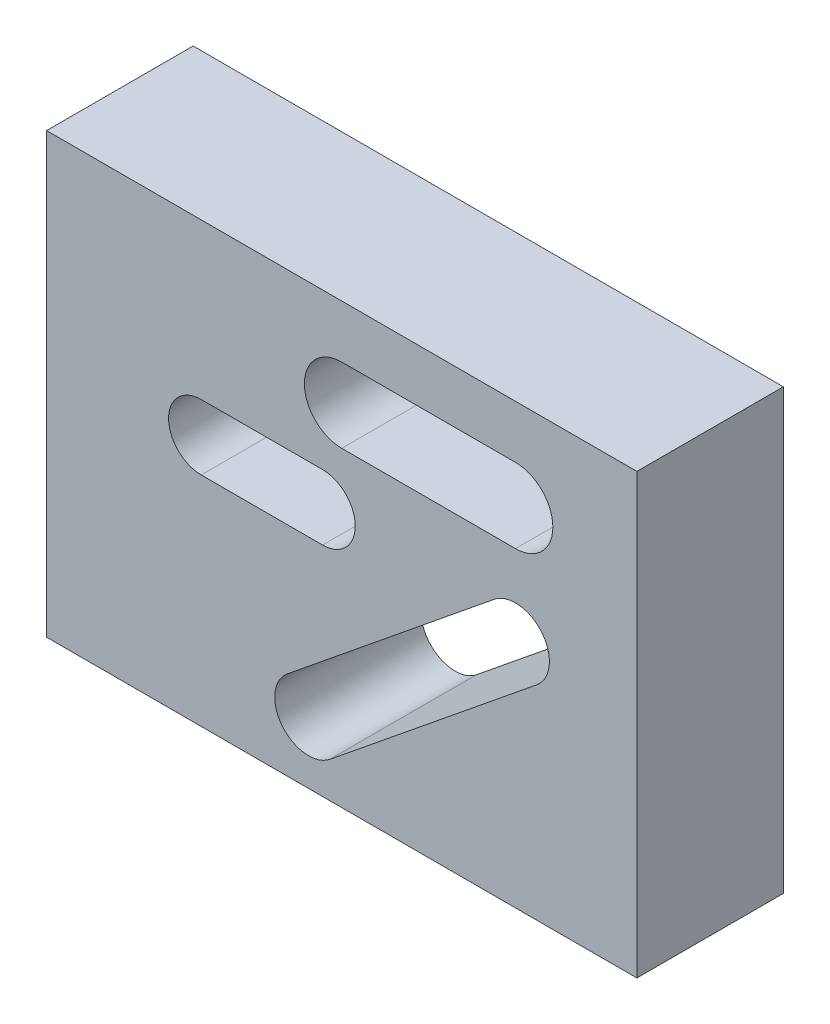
from build123d import *

# Parameters (mm, degrees)
SKIZZE1_W                       = 104.749436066
SKIZZE1_H                       = 77.860722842
AUFSATZ_LINEAR_AUSTRAGEN1_DEPTH = 26


with BuildPart() as part:
    # Skizze1 → Aufsatz-Linear austragen1 (new body)
    with BuildSketch(Plane.XY):
        with Locations((52.374718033, 38.930361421)):
            Rectangle(SKIZZE1_W, SKIZZE1_H)
        with BuildLine():
            Line((52.374718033, 68.473259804), (83.21349145, 68.473259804))
            ThreePointArc((83.21349145, 68.473259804), (89.839935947, 61.846815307), (83.21349145, 55.22037081))
            Line((83.21349145, 55.22037081), (52.374718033, 55.22037081))
            ThreePointArc((52.374718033, 55.22037081), (45.748273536, 61.846815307), (52.374718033, 68.473259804))
        make_face(mode=Mode.SUBTRACT)
        with BuildLine():
            Line((27.440916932, 50.250537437), (48.976861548, 50.250537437))
            ThreePointArc((48.976861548, 50.250537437), (54.775000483, 44.452398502), (48.976861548, 38.654259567))
            Line((48.976861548, 38.654259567), (27.440916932, 38.654259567))
            ThreePointArc((27.440916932, 38.654259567), (21.642777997, 44.452398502), (27.440916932, 50.250537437))
        make_face(mode=Mode.SUBTRACT)
        with BuildLine():
            Line((87.00372379, 36.195473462), (50.282177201, 6.376473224))
            ThreePointArc((50.282177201, 6.376473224), (41.824343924, 7.253841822), (42.701712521, 15.7116751))
            Line((42.701712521, 15.7116751), (79.423259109, 45.530675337))
            ThreePointArc((79.423259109, 45.530675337), (87.881092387, 44.65330674), (87.00372379, 36.195473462))
        make_face(mode=Mode.SUBTRACT)
    extrude(amount=AUFSATZ_LINEAR_AUSTRAGEN1_DEPTH)


solid = part.part
